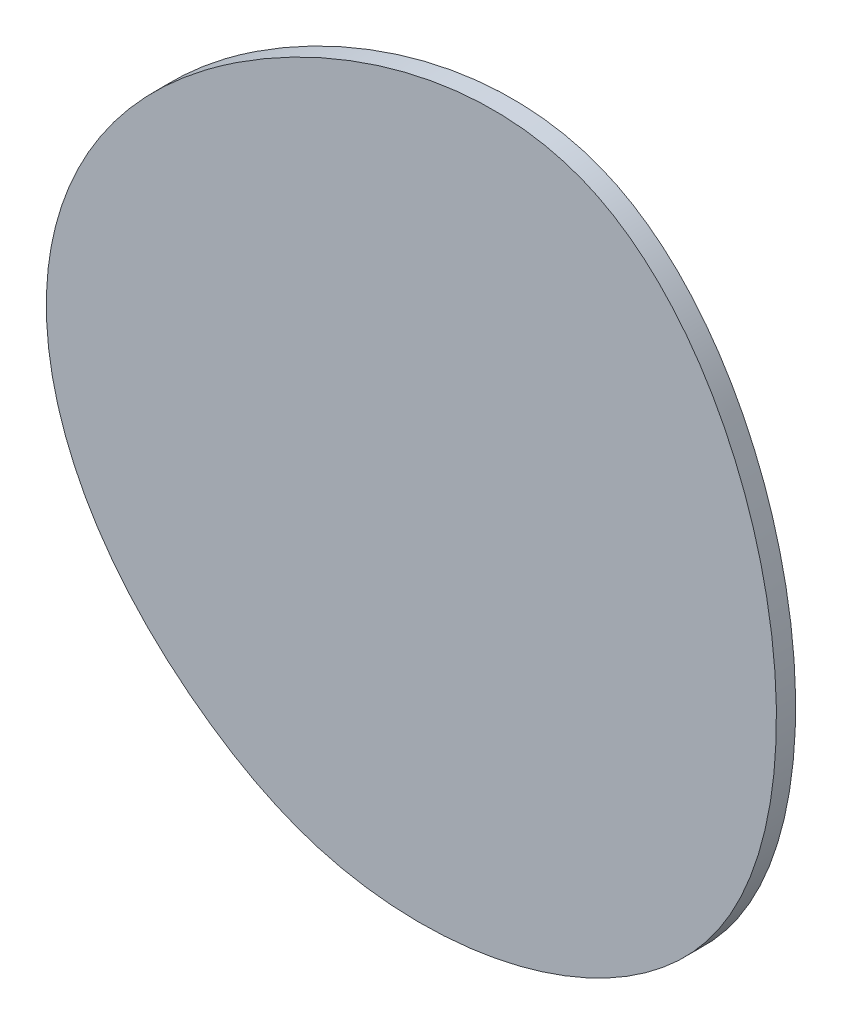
ISO-10303-21;
HEADER;
FILE_DESCRIPTION(('STEP AP214'),'2;1');
FILE_NAME('part.step','',(''),(''),'','','');
FILE_SCHEMA(('AUTOMOTIVE_DESIGN { 1 0 10303 214 1 1 1 1 }'));
ENDSEC;
DATA;
#1=APPLICATION_CONTEXT('core data for automotive mechanical design processes');
#2=APPLICATION_PROTOCOL_DEFINITION('international standard','automotive_design',2000,#1);
#3=PRODUCT_CONTEXT('',#1,'mechanical');
#4=PRODUCT('Part','Part','',(#3));
#5=PRODUCT_RELATED_PRODUCT_CATEGORY('part','',(#4));
#6=PRODUCT_DEFINITION_FORMATION('','',#4);
#7=PRODUCT_DEFINITION_CONTEXT('part definition',#1,'design');
#8=PRODUCT_DEFINITION('design','',#6,#7);
#9=PRODUCT_DEFINITION_SHAPE('','',#8);
#10=(LENGTH_UNIT() NAMED_UNIT(*) SI_UNIT(.MILLI.,.METRE.));
#11=(NAMED_UNIT(*) PLANE_ANGLE_UNIT() SI_UNIT($,.RADIAN.));
#12=(NAMED_UNIT(*) SI_UNIT($,.STERADIAN.) SOLID_ANGLE_UNIT());
#13=UNCERTAINTY_MEASURE_WITH_UNIT(LENGTH_MEASURE(1.E-05),#10,'distance_accuracy_value','');
#14=(GEOMETRIC_REPRESENTATION_CONTEXT(3) GLOBAL_UNCERTAINTY_ASSIGNED_CONTEXT((#13)) GLOBAL_UNIT_ASSIGNED_CONTEXT((#10,
#11,#12)) REPRESENTATION_CONTEXT('',''));
#15=CARTESIAN_POINT('',(0.,0.,0.));
#16=DIRECTION('',(0.,0.,1.));
#17=DIRECTION('',(1.,0.,0.));
#18=AXIS2_PLACEMENT_3D('',#15,#16,#17);
#19=CARTESIAN_POINT('',(-2.89735721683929,4.49962361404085,0.3));
#20=CARTESIAN_POINT('',(-6.23383408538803,1.9689089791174,0.3));
#21=CARTESIAN_POINT('',(-6.15082446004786,-2.46769452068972,0.3));
#22=CARTESIAN_POINT('',(0.0147229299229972,-6.01221690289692,0.3));
#23=CARTESIAN_POINT('',(7.79551564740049,-4.06748076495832,0.3));
#24=CARTESIAN_POINT('',(5.08211809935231,8.14538754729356,0.3));
#25=CARTESIAN_POINT('',(-1.23532104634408,5.76027652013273,0.3));
#26=CARTESIAN_POINT('',(-2.89735721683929,4.49962361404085,0.3));
#27=B_SPLINE_CURVE_WITH_KNOTS('',3,(#19,#20,#21,#22,#23,#24,#25,#26),.UNSPECIFIED.,.T.,.F.,(4,1,
1,1,1,4),(0.,0.339775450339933,0.397134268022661,0.573588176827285,0.830743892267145,1.),.UNSPECIFIED.);
#28=DIRECTION('',(0.,0.,-1.));
#29=VECTOR('',#28,1.);
#30=SURFACE_OF_LINEAR_EXTRUSION('',#27,#29);
#31=CARTESIAN_POINT('',(-2.89735721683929,4.49962361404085,0.3));
#32=VERTEX_POINT('',#31);
#33=EDGE_CURVE('E10',#32,#32,#27,.T.);
#34=ORIENTED_EDGE('',*,*,#33,.F.);
#35=EDGE_LOOP('',(#34));
#36=FACE_BOUND('',#35,.T.);
#37=CARTESIAN_POINT('',(-2.89735721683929,4.49962361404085,0.));
#38=CARTESIAN_POINT('',(-6.23383408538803,1.9689089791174,0.));
#39=CARTESIAN_POINT('',(-6.15082446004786,-2.46769452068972,0.));
#40=CARTESIAN_POINT('',(0.0147229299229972,-6.01221690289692,0.));
#41=CARTESIAN_POINT('',(7.79551564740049,-4.06748076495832,0.));
#42=CARTESIAN_POINT('',(5.08211809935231,8.14538754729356,0.));
#43=CARTESIAN_POINT('',(-1.23532104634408,5.76027652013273,0.));
#44=CARTESIAN_POINT('',(-2.89735721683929,4.49962361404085,0.));
#45=B_SPLINE_CURVE_WITH_KNOTS('',3,(#37,#38,#39,#40,#41,#42,#43,#44),.UNSPECIFIED.,.T.,.F.,(4,1,
1,1,1,4),(0.,0.339775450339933,0.397134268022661,0.573588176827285,0.830743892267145,1.),.UNSPECIFIED.);
#46=CARTESIAN_POINT('',(-2.89735721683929,4.49962361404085,0.));
#47=VERTEX_POINT('',#46);
#48=EDGE_CURVE('E39',#47,#47,#45,.T.);
#49=ORIENTED_EDGE('',*,*,#48,.T.);
#50=EDGE_LOOP('',(#49));
#51=FACE_BOUND('',#50,.T.);
#52=ADVANCED_FACE('F35',(#36,#51),#30,.F.);
#53=CARTESIAN_POINT('',(2.77769163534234,-4.93180825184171,0.3));
#54=DIRECTION('',(0.,0.,1.));
#55=DIRECTION('',(1.,0.,0.));
#56=AXIS2_PLACEMENT_3D('',#53,#54,#55);
#57=PLANE('',#56);
#58=ORIENTED_EDGE('',*,*,#33,.T.);
#59=EDGE_LOOP('',(#58));
#60=FACE_BOUND('',#59,.T.);
#61=ADVANCED_FACE('F58',(#60),#57,.T.);
#62=CARTESIAN_POINT('',(2.77769163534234,-4.93180825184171,0.));
#63=DIRECTION('',(0.,0.,1.));
#64=DIRECTION('',(1.,0.,0.));
#65=AXIS2_PLACEMENT_3D('',#62,#63,#64);
#66=PLANE('',#65);
#67=ORIENTED_EDGE('',*,*,#48,.F.);
#68=EDGE_LOOP('',(#67));
#69=FACE_BOUND('',#68,.T.);
#70=ADVANCED_FACE('F56',(#69),#66,.F.);
#71=CLOSED_SHELL('',(#52,#61,#70));
#72=MANIFOLD_SOLID_BREP('B2',#71);
#73=ADVANCED_BREP_SHAPE_REPRESENTATION('',(#18,#72),#14);
#74=SHAPE_DEFINITION_REPRESENTATION(#9,#73);
ENDSEC;
END-ISO-10303-21;
